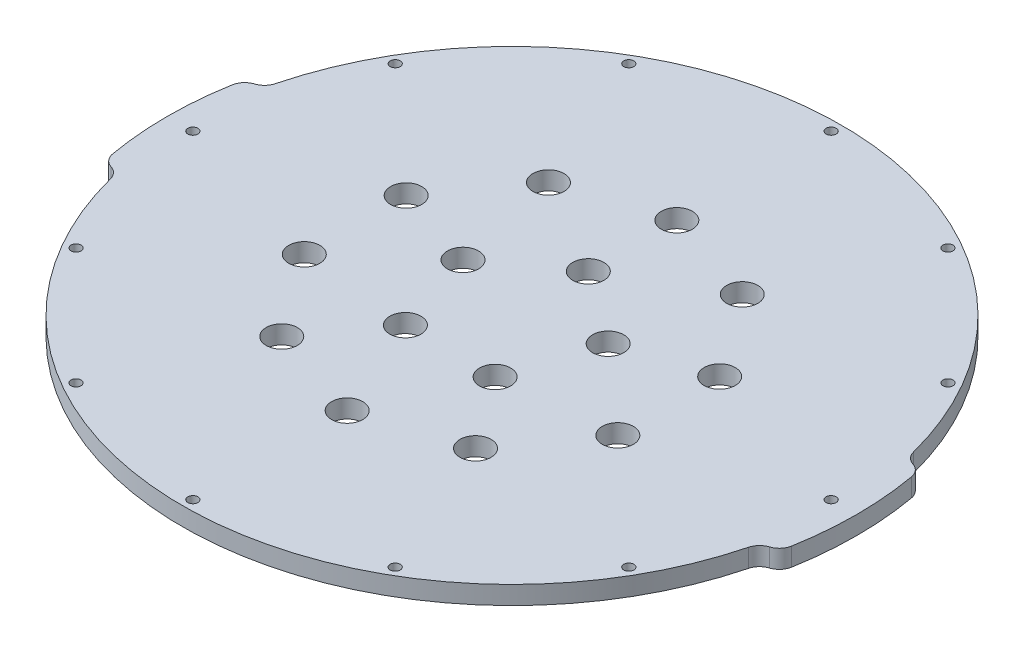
from build123d import *

# Parameters (mm, degrees)
SKETCH1_R           = 1.65
BOSS_EXTRUDE1_DEPTH = 6
FILLET1_R           = 5
SKETCH2_R           = 5.1
CUT_EXTRUDE1_DEPTH  = 157.355060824


with BuildPart() as part:
    # Sketch1 → Boss-Extrude1 (new body)
    with BuildSketch(Plane(origin=(0, 0, 0), x_dir=(1, 0, 0), z_dir=(0, 1, 0))):
        with BuildLine():
            ThreePointArc((-111.234035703, -19.613561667), (-112.95, 0), (-111.234035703, 19.613561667))
            ThreePointArc((-111.234035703, 19.613561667), (-109.13025705, 22.87401705), (-105.327953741, 23.647931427))
            ThreePointArc((-105.327953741, 23.647931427), (0, 107.95), (105.327953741, 23.647931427))
            ThreePointArc((105.327953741, 23.647931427), (109.13025705, 22.87401705), (111.234035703, 19.613561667))
            ThreePointArc((111.234035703, 19.613561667), (112.95, 0), (111.234035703, -19.613561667))
            ThreePointArc((111.234035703, -19.613561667), (109.13025705, -22.87401705), (105.327953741, -23.647931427))
            ThreePointArc((105.327953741, -23.647931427), (0, -107.95), (-105.327953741, -23.647931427))
            ThreePointArc((-105.327953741, -23.647931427), (-109.13025705, -22.87401705), (-111.234035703, -19.613561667))
        make_face()
        with Locations(Location((0, 104.55, 0), (0, 0, 270))):
            Circle(SKETCH1_R, mode=Mode.SUBTRACT)
        with Locations(Location((52.275, 90.542955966, 0), (0, 0, 270))):
            Circle(SKETCH1_R, mode=Mode.SUBTRACT)
        with Locations(Location((90.542955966, 52.275, 0), (0, 0, 270))):
            Circle(SKETCH1_R, mode=Mode.SUBTRACT)
        with Locations(Location((104.55, 0, 0), (0, 0, 270))):
            Circle(SKETCH1_R, mode=Mode.SUBTRACT)
        with Locations(Location((90.542955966, -52.275, 0), (0, 0, 270))):
            Circle(SKETCH1_R, mode=Mode.SUBTRACT)
        with Locations(Location((52.275, -90.542955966, 0), (0, 0, 270))):
            Circle(SKETCH1_R, mode=Mode.SUBTRACT)
        with Locations(Location((0, -104.55, 0), (0, 0, 270))):
            Circle(SKETCH1_R, mode=Mode.SUBTRACT)
        with Locations(Location((-52.275, -90.542955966, 0), (0, 0, 270))):
            Circle(SKETCH1_R, mode=Mode.SUBTRACT)
        with Locations(Location((-90.542955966, -52.275, 0), (0, 0, 270))):
            Circle(SKETCH1_R, mode=Mode.SUBTRACT)
        with Locations(Location((-104.55, 0, 0), (0, 0, 270))):
            Circle(SKETCH1_R, mode=Mode.SUBTRACT)
        with Locations(Location((-90.542955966, 52.275, 0), (0, 0, 270))):
            Circle(SKETCH1_R, mode=Mode.SUBTRACT)
        with Locations(Location((-52.275, 90.542955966, 0), (0, 0, 270))):
            Circle(SKETCH1_R, mode=Mode.SUBTRACT)
    extrude(amount=BOSS_EXTRUDE1_DEPTH)

    # Fillet1
    fillet1_edges = [part.edges().sort_by_distance(p)[0] for p in [
        (-105.327953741, 3, -23.647931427),
        (105.327953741, 3, -23.647931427),
        (105.327953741, 3, 23.647931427),
        (-105.327953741, 3, 23.647931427),
    ]]
    fillet(fillet1_edges, radius=FILLET1_R)

    # Sketch2 → Cut-Extrude1 (cut, through all)
    with BuildSketch(Plane(origin=(0, 6, 0), x_dir=(1, 0, 0), z_dir=(0, 1, 0))):
        with Locations(Location((0, 54, 0), (0, 0, 270))):
            Circle(SKETCH2_R)
        with Locations(Location((31.740403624, 43.686917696, 0), (0, 0, 270))):
            Circle(SKETCH2_R)
        with Locations(Location((51.35705188, 16.686917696, 0), (0, 0, 270))):
            Circle(SKETCH2_R)
        with Locations(Location((51.35705188, -16.686917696, 0), (0, 0, 270))):
            Circle(SKETCH2_R)
        with Locations(Location((31.740403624, -43.686917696, 0), (0, 0, 270))):
            Circle(SKETCH2_R)
        with Locations(Location((0, -54, 0), (0, 0, 270))):
            Circle(SKETCH2_R)
        with Locations(Location((-31.740403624, -43.686917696, 0), (0, 0, 270))):
            Circle(SKETCH2_R)
        with Locations(Location((-51.35705188, -16.686917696, 0), (0, 0, 270))):
            Circle(SKETCH2_R)
        with Locations(Location((-51.35705188, 16.686917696, 0), (0, 0, 270))):
            Circle(SKETCH2_R)
        with Locations(Location((-31.740403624, 43.686917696, 0), (0, 0, 270))):
            Circle(SKETCH2_R)
        with Locations(Location((14.694631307, -20.225424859, 0), (0, 0, 270))):
            Circle(SKETCH2_R)
        with Locations(Location((-14.694631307, -20.225424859, 0), (0, 0, 270))):
            Circle(SKETCH2_R)
        with Locations(Location((-23.776412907, 7.725424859, 0), (0, 0, 270))):
            Circle(SKETCH2_R)
        with Locations(Location((0, 25, 0), (0, 0, 270))):
            Circle(SKETCH2_R)
        with Locations(Location((23.776412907, 7.725424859, 0), (0, 0, 270))):
            Circle(SKETCH2_R)
    extrude(amount=-CUT_EXTRUDE1_DEPTH, mode=Mode.SUBTRACT)


solid = part.part
